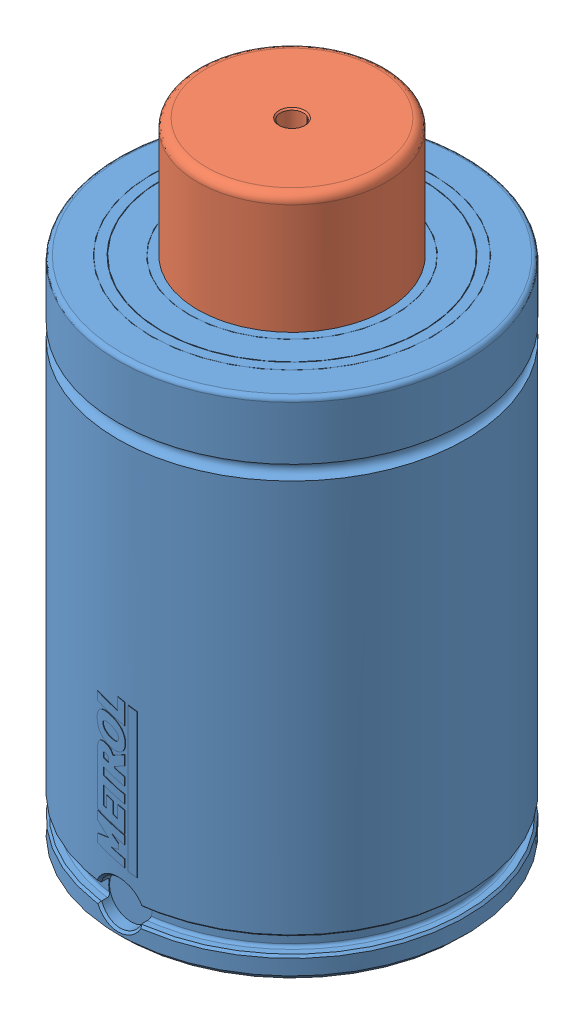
SolidWorks assembly ISNG5000-038.SLDASM, configuration Default (file format 7000). Lengths in mm.
Overall size (120 216 120.11).
2 component instances, 2 part files, 5 mates.
Components (placement in the parent):
- ISNG-5000 Body-1: ISNG-5000 Body.SLDPRT [ISNG-5000-38.1] x (0 0 1) z (0 -1 0) size (120.11 120 174.9)
- ISNG-5000 Piston-1: ISNG-5000 Piston.SLDPRT [ISNG-5000-38.1] at (0 149.9 0) x (0.633384 0 0.773838) z (0 -1 0) size (85 85 66.1)
Mates (geometry in assembly coordinates):
- Concentric1: concentric aligned: cylinder of ISNG-5000 Body-1 through (0 0 0) axis (0 -1 0) radius 32.5; cylinder of ISNG-5000 Piston-1 through (0 149.9 0) axis (0 -1 0) radius 32.5
- LimitDistance2: limit distance anti-aligned: plane of ISNG-5000 Body-1 through (-32.5 154.9 0) normal (0 -1 0); plane of ISNG-5000 Piston-1 through (-32.8881 154.9 26.9188) normal (0 1 0)
- Coincident1: coincident anti-aligned: plane of ISNG-5000 Body-1 through (0 0 0) normal (0 -1 0); plane of assembly through (0 0 0) normal (0 1 0)
- Coincident2: coincident aligned: plane of ISNG-5000 Body-1; plane of assembly through (0 0 0) normal (0 0 1)
- Coincident3: coincident anti-aligned: plane of ISNG-5000 Body-1; plane of assembly through (0 0 0) normal (1 0 0)
